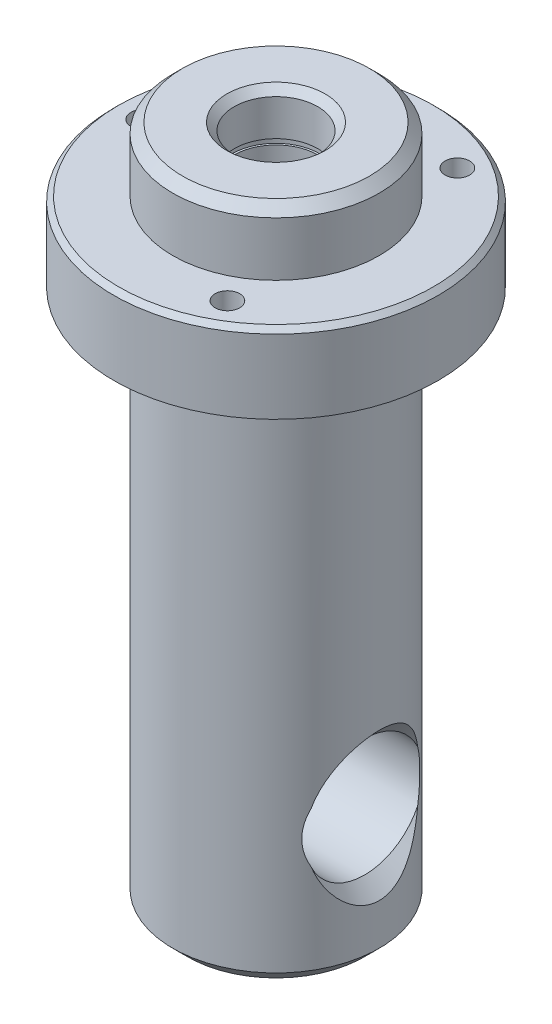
ISO-10303-21;
HEADER;
FILE_DESCRIPTION(('STEP AP214'),'2;1');
FILE_NAME('part.step','',(''),(''),'','','');
FILE_SCHEMA(('AUTOMOTIVE_DESIGN { 1 0 10303 214 1 1 1 1 }'));
ENDSEC;
DATA;
#1=APPLICATION_CONTEXT('core data for automotive mechanical design processes');
#2=APPLICATION_PROTOCOL_DEFINITION('international standard','automotive_design',2000,#1);
#3=PRODUCT_CONTEXT('',#1,'mechanical');
#4=PRODUCT('Part','Part','',(#3));
#5=PRODUCT_RELATED_PRODUCT_CATEGORY('part','',(#4));
#6=PRODUCT_DEFINITION_FORMATION('','',#4);
#7=PRODUCT_DEFINITION_CONTEXT('part definition',#1,'design');
#8=PRODUCT_DEFINITION('design','',#6,#7);
#9=PRODUCT_DEFINITION_SHAPE('','',#8);
#10=(LENGTH_UNIT() NAMED_UNIT(*) SI_UNIT(.MILLI.,.METRE.));
#11=(NAMED_UNIT(*) PLANE_ANGLE_UNIT() SI_UNIT($,.RADIAN.));
#12=(NAMED_UNIT(*) SI_UNIT($,.STERADIAN.) SOLID_ANGLE_UNIT());
#13=UNCERTAINTY_MEASURE_WITH_UNIT(LENGTH_MEASURE(1.E-05),#10,'distance_accuracy_value','');
#14=(GEOMETRIC_REPRESENTATION_CONTEXT(3) GLOBAL_UNCERTAINTY_ASSIGNED_CONTEXT((#13)) GLOBAL_UNIT_ASSIGNED_CONTEXT((#10,
#11,#12)) REPRESENTATION_CONTEXT('',''));
#15=CARTESIAN_POINT('',(0.,0.,0.));
#16=DIRECTION('',(0.,0.,1.));
#17=DIRECTION('',(1.,0.,0.));
#18=AXIS2_PLACEMENT_3D('',#15,#16,#17);
#19=CARTESIAN_POINT('',(0.,0.,0.));
#20=DIRECTION('',(0.,1.,0.));
#21=DIRECTION('',(-1.,0.,0.));
#22=AXIS2_PLACEMENT_3D('',#19,#20,#21);
#23=PLANE('',#22);
#24=CARTESIAN_POINT('',(9.5062846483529E-13,0.,0.));
#25=DIRECTION('',(0.,1.,0.));
#26=DIRECTION('',(-1.,0.,0.));
#27=AXIS2_PLACEMENT_3D('',#24,#25,#26);
#28=CIRCLE('',#27,9.99999999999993);
#29=CARTESIAN_POINT('',(-9.99999999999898,0.,0.));
#30=VERTEX_POINT('',#29);
#31=EDGE_CURVE('E100',#30,#30,#28,.F.);
#32=ORIENTED_EDGE('',*,*,#31,.T.);
#33=EDGE_LOOP('',(#32));
#34=FACE_BOUND('',#33,.T.);
#35=CARTESIAN_POINT('',(9.51052093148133E-13,0.,0.));
#36=DIRECTION('',(0.,1.,0.));
#37=DIRECTION('',(-1.,0.,0.));
#38=AXIS2_PLACEMENT_3D('',#35,#36,#37);
#39=CIRCLE('',#38,19.0000000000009);
#40=CARTESIAN_POINT('',(-18.9999999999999,0.,0.));
#41=VERTEX_POINT('',#40);
#42=EDGE_CURVE('E178',#41,#41,#39,.T.);
#43=ORIENTED_EDGE('',*,*,#42,.T.);
#44=EDGE_LOOP('',(#43));
#45=FACE_BOUND('',#44,.T.);
#46=ADVANCED_FACE('F31',(#34,#45),#23,.T.);
#47=CARTESIAN_POINT('',(0.,-138.,0.));
#48=DIRECTION('',(0.,1.,0.));
#49=DIRECTION('',(-1.,0.,0.));
#50=AXIS2_PLACEMENT_3D('',#47,#48,#49);
#51=CYLINDRICAL_SURFACE('',#50,21.0000000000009);
#52=CARTESIAN_POINT('',(9.37291801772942E-13,-2.00000000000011,0.));
#53=DIRECTION('',(0.,1.,0.));
#54=DIRECTION('',(-1.,0.,0.));
#55=AXIS2_PLACEMENT_3D('',#52,#53,#54);
#56=CIRCLE('',#55,21.0000000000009);
#57=CARTESIAN_POINT('',(-21.,-1.99999999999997,0.));
#58=VERTEX_POINT('',#57);
#59=EDGE_CURVE('E175',#58,#58,#56,.F.);
#60=ORIENTED_EDGE('',*,*,#59,.T.);
#61=EDGE_LOOP('',(#60));
#62=FACE_BOUND('',#61,.T.);
#63=CARTESIAN_POINT('',(8.61610199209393E-13,-13.0000000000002,0.));
#64=DIRECTION('',(0.,1.,0.));
#65=DIRECTION('',(-1.,0.,0.));
#66=AXIS2_PLACEMENT_3D('',#63,#64,#65);
#67=CIRCLE('',#66,21.0000000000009);
#68=CARTESIAN_POINT('',(-21.,-13.,0.));
#69=VERTEX_POINT('',#68);
#70=EDGE_CURVE('E181',#69,#69,#67,.T.);
#71=ORIENTED_EDGE('',*,*,#70,.T.);
#72=EDGE_LOOP('',(#71));
#73=FACE_BOUND('',#72,.T.);
#74=ADVANCED_FACE('F317',(#62,#73),#51,.T.);
#75=CARTESIAN_POINT('',(-21.,-13.,0.));
#76=DIRECTION('',(0.,1.,0.));
#77=DIRECTION('',(-1.,0.,0.));
#78=AXIS2_PLACEMENT_3D('',#75,#76,#77);
#79=PLANE('',#78);
#80=CARTESIAN_POINT('',(13.4999999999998,-13.,-23.38268590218));
#81=DIRECTION('',(0.,1.,0.));
#82=DIRECTION('',(0.,0.,1.));
#83=AXIS2_PLACEMENT_3D('',#80,#81,#82);
#84=CIRCLE('',#83,2.5);
#85=CARTESIAN_POINT('',(13.4999999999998,-13.,-20.88268590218));
#86=VERTEX_POINT('',#85);
#87=EDGE_CURVE('E245',#86,#86,#84,.T.);
#88=ORIENTED_EDGE('',*,*,#87,.F.);
#89=EDGE_LOOP('',(#88));
#90=FACE_BOUND('',#89,.T.);
#91=CARTESIAN_POINT('',(13.5000000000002,-13.,23.3826859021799));
#92=DIRECTION('',(0.,1.,0.));
#93=DIRECTION('',(0.,0.,1.));
#94=AXIS2_PLACEMENT_3D('',#91,#92,#93);
#95=CIRCLE('',#94,2.5);
#96=CARTESIAN_POINT('',(13.5000000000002,-13.,25.8826859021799));
#97=VERTEX_POINT('',#96);
#98=EDGE_CURVE('E239',#97,#97,#95,.T.);
#99=ORIENTED_EDGE('',*,*,#98,.F.);
#100=EDGE_LOOP('',(#99));
#101=FACE_BOUND('',#100,.T.);
#102=CARTESIAN_POINT('',(-27.0000000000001,-13.,0.));
#103=DIRECTION('',(0.,1.,0.));
#104=DIRECTION('',(0.,0.,1.));
#105=AXIS2_PLACEMENT_3D('',#102,#103,#104);
#106=CIRCLE('',#105,2.5);
#107=CARTESIAN_POINT('',(-27.0000000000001,-13.,2.5));
#108=VERTEX_POINT('',#107);
#109=EDGE_CURVE('E233',#108,#108,#106,.T.);
#110=ORIENTED_EDGE('',*,*,#109,.F.);
#111=EDGE_LOOP('',(#110));
#112=FACE_BOUND('',#111,.T.);
#113=CARTESIAN_POINT('',(8.61610199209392E-13,-13.0000000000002,0.));
#114=DIRECTION('',(0.,1.,0.));
#115=DIRECTION('',(-1.,0.,0.));
#116=AXIS2_PLACEMENT_3D('',#113,#114,#115);
#117=CIRCLE('',#116,32.0000000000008);
#118=CARTESIAN_POINT('',(-32.,-13.,0.));
#119=VERTEX_POINT('',#118);
#120=EDGE_CURVE('E172',#119,#119,#117,.T.);
#121=ORIENTED_EDGE('',*,*,#120,.T.);
#122=EDGE_LOOP('',(#121));
#123=FACE_BOUND('',#122,.T.);
#124=ORIENTED_EDGE('',*,*,#70,.F.);
#125=EDGE_LOOP('',(#124));
#126=FACE_BOUND('',#125,.T.);
#127=ADVANCED_FACE('F322',(#90,#101,#112,#123,#126),#79,.T.);
#128=CARTESIAN_POINT('',(0.,-138.,0.));
#129=DIRECTION('',(0.,1.,0.));
#130=DIRECTION('',(-1.,0.,0.));
#131=AXIS2_PLACEMENT_3D('',#128,#129,#130);
#132=CYLINDRICAL_SURFACE('',#131,33.0000000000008);
#133=CARTESIAN_POINT('',(8.54730053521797E-13,-14.0000000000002,0.));
#134=DIRECTION('',(0.,1.,0.));
#135=DIRECTION('',(-1.,0.,0.));
#136=AXIS2_PLACEMENT_3D('',#133,#134,#135);
#137=CIRCLE('',#136,33.0000000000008);
#138=CARTESIAN_POINT('',(-33.,-14.,0.));
#139=VERTEX_POINT('',#138);
#140=EDGE_CURVE('E169',#139,#139,#137,.F.);
#141=ORIENTED_EDGE('',*,*,#140,.T.);
#142=EDGE_LOOP('',(#141));
#143=FACE_BOUND('',#142,.T.);
#144=CARTESIAN_POINT('',(7.51527868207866E-13,-29.0000000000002,0.));
#145=DIRECTION('',(0.,1.,0.));
#146=DIRECTION('',(-1.,0.,0.));
#147=AXIS2_PLACEMENT_3D('',#144,#145,#146);
#148=CIRCLE('',#147,33.0000000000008);
#149=CARTESIAN_POINT('',(-33.,-29.,0.));
#150=VERTEX_POINT('',#149);
#151=EDGE_CURVE('E184',#150,#150,#148,.T.);
#152=ORIENTED_EDGE('',*,*,#151,.T.);
#153=EDGE_LOOP('',(#152));
#154=FACE_BOUND('',#153,.T.);
#155=ADVANCED_FACE('F347',(#143,#154),#132,.T.);
#156=CARTESIAN_POINT('',(-33.,-29.,0.));
#157=DIRECTION('',(0.,-1.,0.));
#158=DIRECTION('',(1.,0.,0.));
#159=AXIS2_PLACEMENT_3D('',#156,#157,#158);
#160=PLANE('',#159);
#161=CARTESIAN_POINT('',(7.51527868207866E-13,-29.0000000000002,0.));
#162=DIRECTION('',(0.,1.,0.));
#163=DIRECTION('',(-1.,0.,0.));
#164=AXIS2_PLACEMENT_3D('',#161,#162,#163);
#165=CIRCLE('',#164,26.0000000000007);
#166=CARTESIAN_POINT('',(-25.9999999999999,-29.,0.));
#167=VERTEX_POINT('',#166);
#168=EDGE_CURVE('E187',#167,#167,#165,.T.);
#169=ORIENTED_EDGE('',*,*,#168,.T.);
#170=EDGE_LOOP('',(#169));
#171=FACE_BOUND('',#170,.T.);
#172=ORIENTED_EDGE('',*,*,#151,.F.);
#173=EDGE_LOOP('',(#172));
#174=FACE_BOUND('',#173,.T.);
#175=ADVANCED_FACE('F352',(#171,#174),#160,.T.);
#176=CARTESIAN_POINT('',(7.51527868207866E-13,-29.0000000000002,0.));
#177=DIRECTION('',(0.,1.,0.));
#178=DIRECTION('',(-1.,0.,0.));
#179=AXIS2_PLACEMENT_3D('',#176,#177,#178);
#180=CONICAL_SURFACE('',#179,26.0000000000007,0.78539816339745);
#181=CARTESIAN_POINT('',(7.17127139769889E-13,-34.0000000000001,0.));
#182=DIRECTION('',(0.,1.,0.));
#183=DIRECTION('',(-1.,0.,0.));
#184=AXIS2_PLACEMENT_3D('',#181,#182,#183);
#185=CIRCLE('',#184,21.0000000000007);
#186=CARTESIAN_POINT('',(-21.,-34.,0.));
#187=VERTEX_POINT('',#186);
#188=EDGE_CURVE('E190',#187,#187,#185,.T.);
#189=ORIENTED_EDGE('',*,*,#188,.T.);
#190=EDGE_LOOP('',(#189));
#191=FACE_BOUND('',#190,.T.);
#192=ORIENTED_EDGE('',*,*,#168,.F.);
#193=EDGE_LOOP('',(#192));
#194=FACE_BOUND('',#193,.T.);
#195=ADVANCED_FACE('F359',(#191,#194),#180,.T.);
#196=CARTESIAN_POINT('',(0.,-138.,0.));
#197=DIRECTION('',(0.,1.,0.));
#198=DIRECTION('',(-1.,0.,0.));
#199=AXIS2_PLACEMENT_3D('',#196,#197,#198);
#200=CYLINDRICAL_SURFACE('',#199,21.0000000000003);
#201=CARTESIAN_POINT('',(17.6998000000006,-114.627910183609,11.3011981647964));
#202=CARTESIAN_POINT('',(17.7233754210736,-114.856862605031,11.2642655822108));
#203=CARTESIAN_POINT('',(17.7494790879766,-115.084846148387,11.2231374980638));
#204=CARTESIAN_POINT('',(17.8064558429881,-115.538534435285,11.1325215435));
#205=CARTESIAN_POINT('',(17.8373287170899,-115.764239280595,11.0830340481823));
#206=CARTESIAN_POINT('',(17.9366543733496,-116.437321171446,10.9221057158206));
#207=CARTESIAN_POINT('',(18.0118285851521,-116.880802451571,10.7981769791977));
#208=CARTESIAN_POINT('',(18.1780748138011,-117.758627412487,10.5159238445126));
#209=CARTESIAN_POINT('',(18.2692991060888,-118.192834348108,10.3572660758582));
#210=CARTESIAN_POINT('',(18.4638395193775,-119.044673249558,10.0063418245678));
#211=CARTESIAN_POINT('',(18.5671558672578,-119.462304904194,9.81407471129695));
#212=CARTESIAN_POINT('',(18.7829838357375,-120.280443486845,9.39444074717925));
#213=CARTESIAN_POINT('',(18.8955470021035,-120.680832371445,9.16686983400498));
#214=CARTESIAN_POINT('',(19.1255030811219,-121.458420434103,8.67688959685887));
#215=CARTESIAN_POINT('',(19.2428970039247,-121.835614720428,8.41447296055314));
#216=CARTESIAN_POINT('',(19.4778580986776,-122.560980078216,7.85522668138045));
#217=CARTESIAN_POINT('',(19.5954224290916,-122.909267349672,7.55854755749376));
#218=CARTESIAN_POINT('',(19.826595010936,-123.572968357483,6.92953515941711));
#219=CARTESIAN_POINT('',(19.94020622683,-123.888407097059,6.5972293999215));
#220=CARTESIAN_POINT('',(20.1796979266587,-124.537335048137,5.82847537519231));
#221=CARTESIAN_POINT('',(20.3037250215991,-124.862592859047,5.38429763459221));
#222=CARTESIAN_POINT('',(20.4728930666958,-125.297395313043,4.68174742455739));
#223=CARTESIAN_POINT('',(20.5264651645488,-125.433469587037,4.44154623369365));
#224=CARTESIAN_POINT('',(20.626743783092,-125.685989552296,3.94972264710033));
#225=CARTESIAN_POINT('',(20.6734542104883,-125.802446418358,3.69810685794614));
#226=CARTESIAN_POINT('',(20.7524660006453,-125.998109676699,3.22248547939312));
#227=CARTESIAN_POINT('',(20.7858764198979,-126.080276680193,2.99987888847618));
#228=CARTESIAN_POINT('',(20.8460529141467,-126.227605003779,2.54831540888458));
#229=CARTESIAN_POINT('',(20.8728221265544,-126.292774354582,2.31936157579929));
#230=CARTESIAN_POINT('',(20.9190811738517,-126.405033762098,1.85638010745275));
#231=CARTESIAN_POINT('',(20.9385726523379,-126.452127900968,1.62235363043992));
#232=CARTESIAN_POINT('',(20.9697787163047,-126.527385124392,1.15074672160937));
#233=CARTESIAN_POINT('',(20.9814932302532,-126.555548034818,0.913166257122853));
#234=CARTESIAN_POINT('',(20.9968472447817,-126.592439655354,0.435511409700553));
#235=CARTESIAN_POINT('',(21.0004622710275,-126.601109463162,0.195431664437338));
#236=CARTESIAN_POINT('',(20.9994430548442,-126.598663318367,-0.28460911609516));
#237=CARTESIAN_POINT('',(20.9948087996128,-126.587547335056,-0.524570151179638));
#238=CARTESIAN_POINT('',(20.9774202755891,-126.545754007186,-1.00251416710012));
#239=CARTESIAN_POINT('',(20.9646647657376,-126.515073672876,-1.24049683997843));
#240=CARTESIAN_POINT('',(20.9313826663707,-126.434757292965,-1.71267257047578));
#241=CARTESIAN_POINT('',(20.9108560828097,-126.385121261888,-1.94686563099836));
#242=CARTESIAN_POINT('',(20.8635973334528,-126.270320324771,-2.39998857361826));
#243=CARTESIAN_POINT('',(20.8371686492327,-126.205911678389,-2.6191425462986));
#244=CARTESIAN_POINT('',(20.7782653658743,-126.061566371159,-3.05145281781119));
#245=CARTESIAN_POINT('',(20.7457889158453,-125.981624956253,-3.26460725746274));
#246=CARTESIAN_POINT('',(20.6402464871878,-125.720097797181,-3.893664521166));
#247=CARTESIAN_POINT('',(20.5590430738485,-125.516750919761,-4.29938486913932));
#248=CARTESIAN_POINT('',(20.4051188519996,-125.123875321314,-4.97148770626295));
#249=CARTESIAN_POINT('',(20.3361498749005,-124.945771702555,-5.24563576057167));
#250=CARTESIAN_POINT('',(20.1918508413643,-124.567070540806,-5.77621335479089));
#251=CARTESIAN_POINT('',(20.1165201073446,-124.366470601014,-6.03264100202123));
#252=CARTESIAN_POINT('',(19.9613088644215,-123.945217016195,-6.52791732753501));
#253=CARTESIAN_POINT('',(19.8814185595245,-123.724519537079,-6.76672542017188));
#254=CARTESIAN_POINT('',(19.7190667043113,-123.265924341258,-7.22618588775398));
#255=CARTESIAN_POINT('',(19.6366051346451,-123.028026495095,-7.44683812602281));
#256=CARTESIAN_POINT('',(19.4441005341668,-122.458089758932,-7.93834355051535));
#257=CARTESIAN_POINT('',(19.3337185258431,-122.1203858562,-8.20251103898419));
#258=CARTESIAN_POINT('',(19.1149351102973,-121.422432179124,-8.70018204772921));
#259=CARTESIAN_POINT('',(19.006534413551,-121.062174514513,-8.9336747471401));
#260=CARTESIAN_POINT('',(18.7950073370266,-120.322327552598,-9.37051715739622));
#261=CARTESIAN_POINT('',(18.6918816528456,-119.942735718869,-9.57386289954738));
#262=CARTESIAN_POINT('',(18.4940184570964,-119.167032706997,-9.95070708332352));
#263=CARTESIAN_POINT('',(18.3992788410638,-118.770925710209,-10.1242130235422));
#264=CARTESIAN_POINT('',(18.2440395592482,-118.068562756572,-10.4006362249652));
#265=CARTESIAN_POINT('',(18.1810087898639,-117.765464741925,-10.5102205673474));
#266=CARTESIAN_POINT('',(18.0622565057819,-117.152478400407,-10.7130148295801));
#267=CARTESIAN_POINT('',(18.0065337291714,-116.842591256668,-10.8062275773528));
#268=CARTESIAN_POINT('',(17.9035856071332,-116.217960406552,-10.975951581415));
#269=CARTESIAN_POINT('',(17.8563340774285,-115.903235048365,-11.0525144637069));
#270=CARTESIAN_POINT('',(17.7709800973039,-115.268934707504,-11.1892139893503));
#271=CARTESIAN_POINT('',(17.7328798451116,-114.949358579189,-11.2493466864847));
#272=CARTESIAN_POINT('',(17.6998000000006,-114.627910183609,-11.3011981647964));
#273=B_SPLINE_CURVE_WITH_KNOTS('',3,(#201,#202,#203,#204,#205,#206,#207,#208,#209,#210,#211,
#212,#213,#214,#215,#216,#217,#218,#219,#220,#221,#222,#223,#224,#225,#226,#227,#228,#229,#230,
#231,#232,#233,#234,#235,#236,#237,#238,#239,#240,#241,#242,#243,#244,#245,#246,#247,#248,#249,
#250,#251,#252,#253,#254,#255,#256,#257,#258,#259,#260,#261,#262,#263,#264,#265,#266,#267,#268,
#269,#270,#271,#272),.UNSPECIFIED.,.F.,.F.,(4,2,2,2,2,2,2,2,2,2,2,2,2,2,2,2,2,2,2,2,2,2,2,2,2,2,
2,2,2,2,2,2,2,2,2,4),(0.,0.699208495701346,1.39838562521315,2.796323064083,4.20831903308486,
5.62034149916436,7.04085270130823,8.46166246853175,9.8764522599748,11.290157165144,
12.9762344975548,13.8190808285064,14.6614454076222,15.3796102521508,16.0974351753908,
16.8150978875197,17.5327672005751,18.2526021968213,18.972438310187,19.6923844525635,
20.4123300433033,21.1014365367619,21.7907542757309,23.1686997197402,24.1698681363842,
25.1711433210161,26.1746571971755,27.1781786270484,28.5045312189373,29.8313504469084,
31.158344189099,32.4850039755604,33.4696980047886,34.4542217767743,35.4356478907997,
36.4173095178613),.UNSPECIFIED.);
#274=CARTESIAN_POINT('',(18.0000000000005,-116.796152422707,10.816653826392));
#275=VERTEX_POINT('',#274);
#276=CARTESIAN_POINT('',(18.0000000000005,-116.796152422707,-10.816653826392));
#277=VERTEX_POINT('',#276);
#278=EDGE_CURVE('E44',#275,#277,#273,.T.);
#279=ORIENTED_EDGE('',*,*,#278,.F.);
#280=CARTESIAN_POINT('',(21.0000000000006,-99.6000000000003,0.));
#281=CARTESIAN_POINT('',(20.9999975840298,-99.6000026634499,0.309522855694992));
#282=CARTESIAN_POINT('',(20.9931388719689,-99.6119944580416,0.619141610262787));
#283=CARTESIAN_POINT('',(20.9658672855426,-99.6598171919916,1.23606791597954));
#284=CARTESIAN_POINT('',(20.9454459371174,-99.6956630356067,1.54337390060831));
#285=CARTESIAN_POINT('',(20.8915025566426,-99.790833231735,2.15388740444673));
#286=CARTESIAN_POINT('',(20.8579507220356,-99.8502109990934,2.45708396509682));
#287=CARTESIAN_POINT('',(20.7785867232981,-99.9916801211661,3.0564221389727));
#288=CARTESIAN_POINT('',(20.7327763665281,-100.07376812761,3.3525647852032));
#289=CARTESIAN_POINT('',(20.6302293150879,-100.259263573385,3.93453085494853));
#290=CARTESIAN_POINT('',(20.573545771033,-100.362567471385,4.22039675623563));
#291=CARTESIAN_POINT('',(20.4503833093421,-100.589674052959,4.78167205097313));
#292=CARTESIAN_POINT('',(20.3839040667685,-100.713477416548,5.05708109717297));
#293=CARTESIAN_POINT('',(20.2426090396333,-100.980393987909,5.5959200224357));
#294=CARTESIAN_POINT('',(20.1677981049,-101.123495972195,5.85935674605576));
#295=CARTESIAN_POINT('',(20.0112990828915,-101.428021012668,6.37339229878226));
#296=CARTESIAN_POINT('',(19.9296084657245,-101.589450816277,6.62398635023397));
#297=CARTESIAN_POINT('',(19.7548873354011,-101.941809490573,7.12887289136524));
#298=CARTESIAN_POINT('',(19.6614638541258,-102.134025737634,7.38213105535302));
#299=CARTESIAN_POINT('',(19.4706137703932,-102.537091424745,7.87173733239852));
#300=CARTESIAN_POINT('',(19.3731870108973,-102.747941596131,8.10808478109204));
#301=CARTESIAN_POINT('',(19.1763459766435,-103.187456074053,8.56325309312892));
#302=CARTESIAN_POINT('',(19.0769296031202,-103.41614001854,8.78205408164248));
#303=CARTESIAN_POINT('',(18.878439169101,-103.890149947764,9.20099297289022));
#304=CARTESIAN_POINT('',(18.779365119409,-104.135476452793,9.4011302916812));
#305=CARTESIAN_POINT('',(18.5732442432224,-104.669452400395,9.80259627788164));
#306=CARTESIAN_POINT('',(18.4665032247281,-104.959910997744,10.0016840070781));
#307=CARTESIAN_POINT('',(18.259651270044,-105.558984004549,10.3745172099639));
#308=CARTESIAN_POINT('',(18.1595412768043,-105.867600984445,10.5482590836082));
#309=CARTESIAN_POINT('',(17.9696169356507,-106.501144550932,10.8686484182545));
#310=CARTESIAN_POINT('',(17.8797900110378,-106.826050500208,11.0153291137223));
#311=CARTESIAN_POINT('',(17.7139289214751,-107.490660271,11.2801227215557));
#312=CARTESIAN_POINT('',(17.6378902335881,-107.830359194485,11.3982450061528));
#313=CARTESIAN_POINT('',(17.5180108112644,-108.445553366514,11.5813844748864));
#314=CARTESIAN_POINT('',(17.4707685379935,-108.718622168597,11.6523689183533));
#315=CARTESIAN_POINT('',(17.3882361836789,-109.270791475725,11.7751744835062));
#316=CARTESIAN_POINT('',(17.3529437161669,-109.549890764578,11.8269994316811));
#317=CARTESIAN_POINT('',(17.2955360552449,-110.112150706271,11.9107942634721));
#318=CARTESIAN_POINT('',(17.2734091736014,-110.395307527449,11.9427817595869));
#319=CARTESIAN_POINT('',(17.2430850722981,-110.963938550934,11.9865229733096));
#320=CARTESIAN_POINT('',(17.2348881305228,-111.249412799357,11.9982762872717));
#321=CARTESIAN_POINT('',(17.2327316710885,-111.820914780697,12.0013734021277));
#322=CARTESIAN_POINT('',(17.2387915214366,-112.106942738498,11.9926894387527));
#323=CARTESIAN_POINT('',(17.2649600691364,-112.676999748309,11.9549853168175));
#324=CARTESIAN_POINT('',(17.2850688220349,-112.961028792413,11.9259650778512));
#325=CARTESIAN_POINT('',(17.3386139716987,-113.525216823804,11.8479826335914));
#326=CARTESIAN_POINT('',(17.3720581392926,-113.805373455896,11.7990088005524));
#327=CARTESIAN_POINT('',(17.4511158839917,-114.359850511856,11.6817610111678));
#328=CARTESIAN_POINT('',(17.4967297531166,-114.634170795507,11.6134865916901));
#329=CARTESIAN_POINT('',(17.5984602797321,-115.174336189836,11.4587399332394));
#330=CARTESIAN_POINT('',(17.6545321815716,-115.440211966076,11.3723450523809));
#331=CARTESIAN_POINT('',(17.7757011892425,-115.963533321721,11.1820018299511));
#332=CARTESIAN_POINT('',(17.8408014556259,-116.220975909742,11.0780473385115));
#333=CARTESIAN_POINT('',(18.047099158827,-116.979040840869,10.7411175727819));
#334=CARTESIAN_POINT('',(18.1993477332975,-117.465672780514,10.4829969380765));
#335=CARTESIAN_POINT('',(18.5456054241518,-118.469972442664,9.85934987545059));
#336=CARTESIAN_POINT('',(18.7423969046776,-118.980116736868,9.4832401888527));
#337=CARTESIAN_POINT('',(19.0393169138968,-119.695839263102,8.86325467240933));
#338=CARTESIAN_POINT('',(19.138665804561,-119.926342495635,8.6470779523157));
#339=CARTESIAN_POINT('',(19.3357581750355,-120.369893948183,8.19687346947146));
#340=CARTESIAN_POINT('',(19.4335021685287,-120.58294784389,7.96285155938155));
#341=CARTESIAN_POINT('',(19.6362195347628,-121.013888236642,7.45005653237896));
#342=CARTESIAN_POINT('',(19.7407422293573,-121.229543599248,7.16922574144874));
#343=CARTESIAN_POINT('',(19.9423276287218,-121.636315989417,6.58773491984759));
#344=CARTESIAN_POINT('',(20.0393896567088,-121.827430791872,6.2870730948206));
#345=CARTESIAN_POINT('',(20.2232929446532,-122.183230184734,5.66769121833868));
#346=CARTESIAN_POINT('',(20.3101389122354,-122.347926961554,5.34897958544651));
#347=CARTESIAN_POINT('',(20.4711099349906,-122.649097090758,4.6954090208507));
#348=CARTESIAN_POINT('',(20.5452365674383,-122.785573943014,4.36055209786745));
#349=CARTESIAN_POINT('',(20.6738737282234,-123.020069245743,3.70080771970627));
#350=CARTESIAN_POINT('',(20.7293853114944,-123.120092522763,3.37682840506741));
#351=CARTESIAN_POINT('',(20.8258159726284,-123.292721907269,2.71950215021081));
#352=CARTESIAN_POINT('',(20.866735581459,-123.36532901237,2.3861555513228));
#353=CARTESIAN_POINT('',(20.9327267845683,-123.481976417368,1.713228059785));
#354=CARTESIAN_POINT('',(20.9578113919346,-123.526040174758,1.37365252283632));
#355=CARTESIAN_POINT('',(20.9914017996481,-123.584971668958,0.691174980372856));
#356=CARTESIAN_POINT('',(20.9999094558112,-123.599842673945,0.348273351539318));
#357=CARTESIAN_POINT('',(21.000078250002,-123.600135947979,-0.295857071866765));
#358=CARTESIAN_POINT('',(20.9936594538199,-123.588914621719,-0.597090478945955));
#359=CARTESIAN_POINT('',(20.9679919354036,-123.543911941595,-1.19729317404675));
#360=CARTESIAN_POINT('',(20.9487444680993,-123.510132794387,-1.49626268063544));
#361=CARTESIAN_POINT('',(20.8978837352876,-123.420444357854,-2.08978082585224));
#362=CARTESIAN_POINT('',(20.8662705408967,-123.364535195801,-2.384329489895));
#363=CARTESIAN_POINT('',(20.791418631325,-123.231256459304,-2.96701920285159));
#364=CARTESIAN_POINT('',(20.748179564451,-123.153886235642,-3.2551600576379));
#365=CARTESIAN_POINT('',(20.6515541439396,-122.979450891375,-3.82029452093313));
#366=CARTESIAN_POINT('',(20.5982776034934,-122.882598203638,-4.09737271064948));
#367=CARTESIAN_POINT('',(20.4824154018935,-122.669657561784,-4.64200153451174));
#368=CARTESIAN_POINT('',(20.4198299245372,-122.553569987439,-4.90955235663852));
#369=CARTESIAN_POINT('',(20.2866026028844,-122.30315296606,-5.43386830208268));
#370=CARTESIAN_POINT('',(20.215960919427,-122.1688238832,-5.69063364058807));
#371=CARTESIAN_POINT('',(20.0679440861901,-121.882866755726,-6.19242141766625));
#372=CARTESIAN_POINT('',(19.9905665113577,-121.73123247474,-6.43743957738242));
#373=CARTESIAN_POINT('',(19.8221944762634,-121.395035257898,-6.93958344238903));
#374=CARTESIAN_POINT('',(19.7306205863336,-121.20868792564,-7.19532119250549));
#375=CARTESIAN_POINT('',(19.5430063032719,-120.817298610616,-7.69031721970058));
#376=CARTESIAN_POINT('',(19.4469656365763,-120.612255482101,-7.92957448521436));
#377=CARTESIAN_POINT('',(19.2523830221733,-120.184323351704,-8.3909773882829));
#378=CARTESIAN_POINT('',(19.1538385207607,-119.961415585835,-8.6131045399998));
#379=CARTESIAN_POINT('',(18.956505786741,-119.498914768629,-9.03913771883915));
#380=CARTESIAN_POINT('',(18.8577175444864,-119.259321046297,-9.2430430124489));
#381=CARTESIAN_POINT('',(18.6512297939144,-118.73668437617,-9.65350316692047));
#382=CARTESIAN_POINT('',(18.5437670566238,-118.451777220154,-9.85781121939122));
#383=CARTESIAN_POINT('',(18.3345970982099,-117.863623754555,-10.2415981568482));
#384=CARTESIAN_POINT('',(18.232890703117,-117.560374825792,-10.4210734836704));
#385=CARTESIAN_POINT('',(18.0388112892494,-116.937251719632,-10.7535253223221));
#386=CARTESIAN_POINT('',(17.9464283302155,-116.6173958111,-10.9065301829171));
#387=CARTESIAN_POINT('',(17.774463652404,-115.962482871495,-11.1845964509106));
#388=CARTESIAN_POINT('',(17.6948780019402,-115.627430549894,-11.3096664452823));
#389=CARTESIAN_POINT('',(17.5672561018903,-115.017242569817,-11.506614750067));
#390=CARTESIAN_POINT('',(17.5161112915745,-114.74457145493,-11.5841485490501));
#391=CARTESIAN_POINT('',(17.4254860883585,-114.192607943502,-11.7200307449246));
#392=CARTESIAN_POINT('',(17.3860033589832,-113.913316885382,-11.7783829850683));
#393=CARTESIAN_POINT('',(17.3200607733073,-113.350042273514,-11.8751392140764));
#394=CARTESIAN_POINT('',(17.2935886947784,-113.066063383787,-11.9135619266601));
#395=CARTESIAN_POINT('',(17.2545686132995,-112.495117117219,-11.9700062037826));
#396=CARTESIAN_POINT('',(17.2420208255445,-112.208149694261,-11.9880274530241));
#397=CARTESIAN_POINT('',(17.2313141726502,-111.632807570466,-12.0034121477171));
#398=CARTESIAN_POINT('',(17.2331844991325,-111.344431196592,-12.0007336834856));
#399=CARTESIAN_POINT('',(17.2513115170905,-110.769076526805,-11.9746606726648));
#400=CARTESIAN_POINT('',(17.2675682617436,-110.482098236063,-11.9512660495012));
#401=CARTESIAN_POINT('',(17.3138686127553,-109.911520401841,-11.8840905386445));
#402=CARTESIAN_POINT('',(17.343919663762,-109.627922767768,-11.840298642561));
#403=CARTESIAN_POINT('',(17.4167354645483,-109.066176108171,-11.732924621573));
#404=CARTESIAN_POINT('',(17.4595004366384,-108.788027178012,-11.6693421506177));
#405=CARTESIAN_POINT('',(17.5554693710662,-108.243656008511,-11.5244478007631));
#406=CARTESIAN_POINT('',(17.6084759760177,-107.977309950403,-11.4434682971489));
#407=CARTESIAN_POINT('',(17.7238615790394,-107.452614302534,-11.2639296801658));
#408=CARTESIAN_POINT('',(17.7862437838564,-107.194267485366,-11.1653645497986));
#409=CARTESIAN_POINT('',(17.9187335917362,-106.686644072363,-10.9514749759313));
#410=CARTESIAN_POINT('',(17.9888419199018,-106.437368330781,-10.8361489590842));
#411=CARTESIAN_POINT('',(18.1351192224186,-105.948725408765,-10.5895232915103));
#412=CARTESIAN_POINT('',(18.2112881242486,-105.709358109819,-10.4582238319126));
#413=CARTESIAN_POINT('',(18.3801499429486,-105.205101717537,-10.1589355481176));
#414=CARTESIAN_POINT('',(18.4735807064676,-104.941962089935,-9.98841069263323));
#415=CARTESIAN_POINT('',(18.6639600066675,-104.430640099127,-9.6279872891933));
#416=CARTESIAN_POINT('',(18.7609088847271,-104.182459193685,-9.43808685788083));
#417=CARTESIAN_POINT('',(18.9561081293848,-103.701752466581,-9.0396464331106));
#418=CARTESIAN_POINT('',(19.0543593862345,-103.469238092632,-8.83109306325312));
#419=CARTESIAN_POINT('',(19.2499275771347,-103.020932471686,-8.39625729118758));
#420=CARTESIAN_POINT('',(19.3472443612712,-102.805143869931,-8.16997209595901));
#421=CARTESIAN_POINT('',(19.5508162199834,-102.365445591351,-7.67117303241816));
#422=CARTESIAN_POINT('',(19.6566700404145,-102.143886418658,-7.39641492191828));
#423=CARTESIAN_POINT('',(19.8616466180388,-101.724860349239,-6.82689863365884));
#424=CARTESIAN_POINT('',(19.9607718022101,-101.52738474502,-6.53214774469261));
#425=CARTESIAN_POINT('',(20.1496021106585,-101.158178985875,-5.92409184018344));
#426=CARTESIAN_POINT('',(20.2393081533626,-100.986446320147,-5.61078863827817));
#427=CARTESIAN_POINT('',(20.4067128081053,-100.670596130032,-4.9675373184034));
#428=CARTESIAN_POINT('',(20.4844147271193,-100.526470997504,-4.63759381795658));
#429=CARTESIAN_POINT('',(20.6129238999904,-100.290686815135,-4.02338086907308));
#430=CARTESIAN_POINT('',(20.6660566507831,-100.194255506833,-3.74142065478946));
#431=CARTESIAN_POINT('',(20.7614719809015,-100.022269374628,-3.16943106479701));
#432=CARTESIAN_POINT('',(20.8037564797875,-99.9467108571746,-2.87940312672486));
#433=CARTESIAN_POINT('',(20.8764287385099,-99.8174652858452,-2.29381256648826));
#434=CARTESIAN_POINT('',(20.9068455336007,-99.763724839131,-1.99826532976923));
#435=CARTESIAN_POINT('',(20.9551997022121,-99.6785220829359,-1.40308275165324));
#436=CARTESIAN_POINT('',(20.9731441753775,-99.6470470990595,-1.10344983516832));
#437=CARTESIAN_POINT('',(20.9897566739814,-99.6179331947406,-0.669340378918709));
#438=CARTESIAN_POINT('',(20.9935953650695,-99.6112110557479,-0.535603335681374));
#439=CARTESIAN_POINT('',(20.9987176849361,-99.6022436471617,-0.2679168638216));
#440=CARTESIAN_POINT('',(21.000001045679,-99.5999988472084,-0.133967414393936));
#441=CARTESIAN_POINT('',(21.0000000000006,-99.6000000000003,0.));
#442=B_SPLINE_CURVE_WITH_KNOTS('',3,(#280,#281,#282,#283,#284,#285,#286,#287,#288,#289,#290,
#291,#292,#293,#294,#295,#296,#297,#298,#299,#300,#301,#302,#303,#304,#305,#306,#307,#308,#309,
#310,#311,#312,#313,#314,#315,#316,#317,#318,#319,#320,#321,#322,#323,#324,#325,#326,#327,#328,
#329,#330,#331,#332,#333,#334,#335,#336,#337,#338,#339,#340,#341,#342,#343,#344,#345,#346,#347,
#348,#349,#350,#351,#352,#353,#354,#355,#356,#357,#358,#359,#360,#361,#362,#363,#364,#365,#366,
#367,#368,#369,#370,#371,#372,#373,#374,#375,#376,#377,#378,#379,#380,#381,#382,#383,#384,#385,
#386,#387,#388,#389,#390,#391,#392,#393,#394,#395,#396,#397,#398,#399,#400,#401,#402,#403,#404,
#405,#406,#407,#408,#409,#410,#411,#412,#413,#414,#415,#416,#417,#418,#419,#420,#421,#422,#423,
#424,#425,#426,#427,#428,#429,#430,#431,#432,#433,#434,#435,#436,#437,#438,#439,#440,#441),
.UNSPECIFIED.,.T.,.F.,(4,2,2,2,2,2,2,2,2,2,2,2,2,2,2,2,2,2,2,2,2,2,2,2,2,2,2,2,2,2,2,2,2,2,2,2,
2,2,2,2,2,2,2,2,2,2,2,2,2,2,2,2,2,2,2,2,2,2,2,2,2,2,2,2,2,2,2,2,2,2,2,2,2,2,2,2,2,2,2,2,4),(0.,
0.928428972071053,1.85743858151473,2.78856912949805,3.71956246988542,4.64611581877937,
5.57269990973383,6.49874743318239,7.42513699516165,8.41827045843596,9.41144291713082,
10.4057249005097,11.4000379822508,12.5025662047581,13.6052508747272,14.7065721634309,
15.8075315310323,16.664868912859,17.5220349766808,18.3784389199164,19.2348599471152,
20.0924451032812,20.9500336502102,21.8081226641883,22.6662322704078,23.5207504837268,
24.3755685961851,26.0843469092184,28.0669593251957,29.0599862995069,30.0526889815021,
31.1588589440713,32.2651291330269,33.3708875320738,34.4765087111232,35.5057877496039,
36.5350293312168,37.563423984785,38.5917035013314,39.4951301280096,40.398468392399,
41.3018014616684,42.2051618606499,43.0991596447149,43.9931397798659,44.8871020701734,
45.7813875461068,46.7686101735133,47.7558933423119,48.7442274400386,49.7326013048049,
50.8313456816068,51.9302473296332,53.0279647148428,54.1253442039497,54.9886403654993,
55.8517634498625,56.7140741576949,57.5763981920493,58.440468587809,59.3045421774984,
60.1690826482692,61.0336382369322,61.8829498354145,62.7325525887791,63.5822351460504,
64.4319075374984,65.4124821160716,66.3931521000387,67.3745310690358,68.3560649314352,
69.4601606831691,70.5638560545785,71.6674437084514,72.7707267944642,73.6778518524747,
74.5848162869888,75.4895476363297,76.3937635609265,76.7955632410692,77.1974050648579),.UNSPECIFIED.);
#443=CARTESIAN_POINT('',(18.0000000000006,-106.403847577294,10.816653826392));
#444=VERTEX_POINT('',#443);
#445=EDGE_CURVE('E91',#444,#275,#442,.T.);
#446=ORIENTED_EDGE('',*,*,#445,.F.);
#447=CARTESIAN_POINT('',(17.6998000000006,-108.572089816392,-11.3011981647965));
#448=CARTESIAN_POINT('',(17.7233754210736,-108.34313739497,-11.2642655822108));
#449=CARTESIAN_POINT('',(17.7494790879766,-108.115153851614,-11.2231374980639));
#450=CARTESIAN_POINT('',(17.8064558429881,-107.661465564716,-11.1325215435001));
#451=CARTESIAN_POINT('',(17.8373287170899,-107.435760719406,-11.0830340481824));
#452=CARTESIAN_POINT('',(17.9366543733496,-106.762678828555,-10.9221057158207));
#453=CARTESIAN_POINT('',(18.0118285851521,-106.31919754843,-10.7981769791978));
#454=CARTESIAN_POINT('',(18.1780748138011,-105.441372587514,-10.5159238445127));
#455=CARTESIAN_POINT('',(18.2692991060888,-105.007165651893,-10.3572660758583));
#456=CARTESIAN_POINT('',(18.4638395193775,-104.155326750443,-10.0063418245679));
#457=CARTESIAN_POINT('',(18.5671558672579,-103.737695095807,-9.81407471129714));
#458=CARTESIAN_POINT('',(18.7829838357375,-102.919556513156,-9.39444074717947));
#459=CARTESIAN_POINT('',(18.8955470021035,-102.519167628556,-9.16686983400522));
#460=CARTESIAN_POINT('',(19.125503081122,-101.741579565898,-8.67688959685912));
#461=CARTESIAN_POINT('',(19.2428970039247,-101.364385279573,-8.41447296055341));
#462=CARTESIAN_POINT('',(19.4778580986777,-100.639019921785,-7.85522668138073));
#463=CARTESIAN_POINT('',(19.5954224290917,-100.290732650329,-7.55854755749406));
#464=CARTESIAN_POINT('',(19.8265950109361,-99.6270316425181,-6.92953515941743));
#465=CARTESIAN_POINT('',(19.94020622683,-99.3115929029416,-6.59722939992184));
#466=CARTESIAN_POINT('',(20.1796979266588,-98.6626649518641,-5.82847537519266));
#467=CARTESIAN_POINT('',(20.3037250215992,-98.3374071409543,-5.38429763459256));
#468=CARTESIAN_POINT('',(20.4728930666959,-97.9026046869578,-4.68174742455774));
#469=CARTESIAN_POINT('',(20.5264651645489,-97.7665304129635,-4.441546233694));
#470=CARTESIAN_POINT('',(20.6267437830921,-97.5140104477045,-3.94972264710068));
#471=CARTESIAN_POINT('',(20.6734542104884,-97.397553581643,-3.6981068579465));
#472=CARTESIAN_POINT('',(20.7524660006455,-97.2018903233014,-3.22248547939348));
#473=CARTESIAN_POINT('',(20.785876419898,-97.1197233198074,-2.99987888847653));
#474=CARTESIAN_POINT('',(20.8460529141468,-96.9723949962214,-2.54831540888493));
#475=CARTESIAN_POINT('',(20.8728221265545,-96.907225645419,-2.31936157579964));
#476=CARTESIAN_POINT('',(20.9190811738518,-96.7949662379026,-1.85638010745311));
#477=CARTESIAN_POINT('',(20.9385726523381,-96.7478720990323,-1.62235363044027));
#478=CARTESIAN_POINT('',(20.9697787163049,-96.6726148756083,-1.15074672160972));
#479=CARTESIAN_POINT('',(20.9814932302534,-96.6444519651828,-0.913166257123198));
#480=CARTESIAN_POINT('',(20.9968472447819,-96.6075603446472,-0.435511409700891));
#481=CARTESIAN_POINT('',(21.0004622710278,-96.5988905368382,-0.195431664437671));
#482=CARTESIAN_POINT('',(20.9994430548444,-96.601336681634,0.284609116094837));
#483=CARTESIAN_POINT('',(20.9948087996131,-96.6124526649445,0.524570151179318));
#484=CARTESIAN_POINT('',(20.9774202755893,-96.6542459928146,1.00251416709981));
#485=CARTESIAN_POINT('',(20.9646647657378,-96.6849263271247,1.24049683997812));
#486=CARTESIAN_POINT('',(20.931382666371,-96.7652427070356,1.71267257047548));
#487=CARTESIAN_POINT('',(20.9108560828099,-96.8148787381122,1.94686563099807));
#488=CARTESIAN_POINT('',(20.863597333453,-96.9296796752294,2.39998857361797));
#489=CARTESIAN_POINT('',(20.8371686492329,-96.9940883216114,2.61914254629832));
#490=CARTESIAN_POINT('',(20.7782653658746,-97.1384336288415,3.05145281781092));
#491=CARTESIAN_POINT('',(20.7457889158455,-97.2183750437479,3.26460725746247));
#492=CARTESIAN_POINT('',(20.640246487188,-97.4799022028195,3.89366452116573));
#493=CARTESIAN_POINT('',(20.5590430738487,-97.6832490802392,4.29938486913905));
#494=CARTESIAN_POINT('',(20.4051188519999,-98.0761246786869,4.97148770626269));
#495=CARTESIAN_POINT('',(20.3361498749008,-98.2542282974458,5.24563576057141));
#496=CARTESIAN_POINT('',(20.1918508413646,-98.6329294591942,5.77621335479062));
#497=CARTESIAN_POINT('',(20.1165201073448,-98.8335293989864,6.03264100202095));
#498=CARTESIAN_POINT('',(19.9613088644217,-99.2547829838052,6.52791732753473));
#499=CARTESIAN_POINT('',(19.8814185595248,-99.4754804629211,6.76672542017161));
#500=CARTESIAN_POINT('',(19.7190667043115,-99.934075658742,7.22618588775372));
#501=CARTESIAN_POINT('',(19.6366051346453,-100.171973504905,7.44683812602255));
#502=CARTESIAN_POINT('',(19.444100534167,-100.741910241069,7.9383435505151));
#503=CARTESIAN_POINT('',(19.3337185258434,-101.0796141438,8.20251103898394));
#504=CARTESIAN_POINT('',(19.1149351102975,-101.777567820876,8.70018204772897));
#505=CARTESIAN_POINT('',(19.0065344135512,-102.137825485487,8.93367474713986));
#506=CARTESIAN_POINT('',(18.7950073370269,-102.877672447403,9.370517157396));
#507=CARTESIAN_POINT('',(18.6918816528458,-103.257264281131,9.57386289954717));
#508=CARTESIAN_POINT('',(18.4940184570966,-104.032967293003,9.95070708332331));
#509=CARTESIAN_POINT('',(18.399278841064,-104.429074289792,10.124213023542));
#510=CARTESIAN_POINT('',(18.2440395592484,-105.131437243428,10.4006362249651));
#511=CARTESIAN_POINT('',(18.1810087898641,-105.434535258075,10.5102205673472));
#512=CARTESIAN_POINT('',(18.0622565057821,-106.047521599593,10.71301482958));
#513=CARTESIAN_POINT('',(18.0065337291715,-106.357408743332,10.8062275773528));
#514=CARTESIAN_POINT('',(17.9035856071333,-106.982039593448,10.975951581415));
#515=CARTESIAN_POINT('',(17.8563340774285,-107.296764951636,11.0525144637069));
#516=CARTESIAN_POINT('',(17.7709800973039,-107.931065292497,11.1892139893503));
#517=CARTESIAN_POINT('',(17.7328798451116,-108.250641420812,11.2493466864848));
#518=CARTESIAN_POINT('',(17.6998000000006,-108.572089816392,11.3011981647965));
#519=B_SPLINE_CURVE_WITH_KNOTS('',3,(#447,#448,#449,#450,#451,#452,#453,#454,#455,#456,#457,
#458,#459,#460,#461,#462,#463,#464,#465,#466,#467,#468,#469,#470,#471,#472,#473,#474,#475,#476,
#477,#478,#479,#480,#481,#482,#483,#484,#485,#486,#487,#488,#489,#490,#491,#492,#493,#494,#495,
#496,#497,#498,#499,#500,#501,#502,#503,#504,#505,#506,#507,#508,#509,#510,#511,#512,#513,#514,
#515,#516,#517,#518),.UNSPECIFIED.,.F.,.F.,(4,2,2,2,2,2,2,2,2,2,2,2,2,2,2,2,2,2,2,2,2,2,2,2,2,2,
2,2,2,2,2,2,2,2,2,4),(0.,0.699208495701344,1.39838562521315,2.796323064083,4.20831903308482,
5.62034149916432,7.04085270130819,8.46166246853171,9.87645225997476,11.2901571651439,
12.9762344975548,13.8190808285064,14.6614454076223,15.3796102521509,16.0974351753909,
16.8150978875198,17.5327672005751,18.2526021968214,18.9724383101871,19.6923844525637,
20.4123300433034,21.101436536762,21.790754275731,23.1686997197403,24.1698681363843,
25.1711433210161,26.1746571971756,27.1781786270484,28.5045312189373,29.8313504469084,
31.1583441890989,32.4850039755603,33.4696980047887,34.4542217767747,35.4356478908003,
36.4173095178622),.UNSPECIFIED.);
#520=CARTESIAN_POINT('',(18.0000000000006,-106.403847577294,-10.816653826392));
#521=VERTEX_POINT('',#520);
#522=EDGE_CURVE('E50',#521,#444,#519,.T.);
#523=ORIENTED_EDGE('',*,*,#522,.F.);
#524=EDGE_CURVE('E92',#277,#521,#442,.T.);
#525=ORIENTED_EDGE('',*,*,#524,.F.);
#526=EDGE_LOOP('',(#279,#446,#523,#525));
#527=FACE_BOUND('',#526,.T.);
#528=DIRECTION('',(0.,1.,0.));
#529=VECTOR('',#528,1.);
#530=CARTESIAN_POINT('',(-17.,-138.,-12.3288280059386));
#531=LINE('',#530,#529);
#532=CARTESIAN_POINT('',(-17.,-74.5,-12.3288280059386));
#533=VERTEX_POINT('',#532);
#534=CARTESIAN_POINT('',(-17.,-135.,-12.3288280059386));
#535=VERTEX_POINT('',#534);
#536=EDGE_CURVE('E193',#533,#535,#531,.F.);
#537=ORIENTED_EDGE('',*,*,#536,.F.);
#538=CARTESIAN_POINT('',(4.38481239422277E-13,-74.5,0.));
#539=DIRECTION('',(0.,1.,0.));
#540=DIRECTION('',(0.,0.,1.));
#541=AXIS2_PLACEMENT_3D('',#538,#539,#540);
#542=CIRCLE('',#541,21.0000000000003);
#543=CARTESIAN_POINT('',(-17.,-74.5,12.3288280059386));
#544=VERTEX_POINT('',#543);
#545=EDGE_CURVE('E102',#544,#533,#542,.F.);
#546=ORIENTED_EDGE('',*,*,#545,.F.);
#547=DIRECTION('',(0.,1.,0.));
#548=VECTOR('',#547,1.);
#549=CARTESIAN_POINT('',(-17.,-138.,12.3288280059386));
#550=LINE('',#549,#548);
#551=CARTESIAN_POINT('',(-17.,-135.,12.3288280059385));
#552=VERTEX_POINT('',#551);
#553=EDGE_CURVE('E195',#552,#544,#550,.T.);
#554=ORIENTED_EDGE('',*,*,#553,.F.);
#555=CARTESIAN_POINT('',(0.,-135.,0.));
#556=DIRECTION('',(0.,-1.,0.));
#557=DIRECTION('',(1.,0.,0.));
#558=AXIS2_PLACEMENT_3D('',#555,#556,#557);
#559=CIRCLE('',#558,21.0000000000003);
#560=EDGE_CURVE('E166',#552,#535,#559,.F.);
#561=ORIENTED_EDGE('',*,*,#560,.T.);
#562=EDGE_LOOP('',(#537,#546,#554,#561));
#563=FACE_BOUND('',#562,.T.);
#564=ORIENTED_EDGE('',*,*,#188,.F.);
#565=EDGE_LOOP('',(#564));
#566=FACE_BOUND('',#565,.T.);
#567=ADVANCED_FACE('F89',(#527,#563,#566),#200,.T.);
#568=CARTESIAN_POINT('',(-21.,-138.,0.));
#569=DIRECTION('',(0.,-1.,0.));
#570=DIRECTION('',(1.,0.,0.));
#571=AXIS2_PLACEMENT_3D('',#568,#569,#570);
#572=PLANE('',#571);
#573=DIRECTION('',(0.,0.,1.));
#574=VECTOR('',#573,1.);
#575=CARTESIAN_POINT('',(-17.,-138.,0.));
#576=LINE('',#575,#574);
#577=CARTESIAN_POINT('',(-17.,-138.,-5.91607978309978));
#578=VERTEX_POINT('',#577);
#579=CARTESIAN_POINT('',(-17.,-138.,5.91607978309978));
#580=VERTEX_POINT('',#579);
#581=EDGE_CURVE('E197',#578,#580,#576,.T.);
#582=ORIENTED_EDGE('',*,*,#581,.F.);
#583=CARTESIAN_POINT('',(0.,-138.,0.));
#584=DIRECTION('',(0.,-1.,0.));
#585=DIRECTION('',(1.,0.,0.));
#586=AXIS2_PLACEMENT_3D('',#583,#584,#585);
#587=CIRCLE('',#586,18.);
#588=EDGE_CURVE('E163',#578,#580,#587,.T.);
#589=ORIENTED_EDGE('',*,*,#588,.T.);
#590=EDGE_LOOP('',(#582,#589));
#591=FACE_BOUND('',#590,.T.);
#592=ADVANCED_FACE('F332',(#591),#572,.T.);
#593=CARTESIAN_POINT('',(9.51052093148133E-13,0.,0.));
#594=DIRECTION('',(0.,-1.,0.));
#595=DIRECTION('',(1.,0.,0.));
#596=AXIS2_PLACEMENT_3D('',#593,#594,#595);
#597=CONICAL_SURFACE('',#596,19.0000000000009,0.785398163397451);
#598=ORIENTED_EDGE('',*,*,#59,.F.);
#599=EDGE_LOOP('',(#598));
#600=FACE_BOUND('',#599,.T.);
#601=ORIENTED_EDGE('',*,*,#42,.F.);
#602=EDGE_LOOP('',(#601));
#603=FACE_BOUND('',#602,.T.);
#604=ADVANCED_FACE('F329',(#600,#603),#597,.T.);
#605=CARTESIAN_POINT('',(8.61610199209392E-13,-13.0000000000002,0.));
#606=DIRECTION('',(0.,-1.,0.));
#607=DIRECTION('',(1.,0.,0.));
#608=AXIS2_PLACEMENT_3D('',#605,#606,#607);
#609=CONICAL_SURFACE('',#608,32.0000000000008,0.785398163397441);
#610=ORIENTED_EDGE('',*,*,#140,.F.);
#611=EDGE_LOOP('',(#610));
#612=FACE_BOUND('',#611,.T.);
#613=ORIENTED_EDGE('',*,*,#120,.F.);
#614=EDGE_LOOP('',(#613));
#615=FACE_BOUND('',#614,.T.);
#616=ADVANCED_FACE('F331',(#612,#615),#609,.T.);
#617=CARTESIAN_POINT('',(0.,-135.,0.));
#618=DIRECTION('',(0.,1.,0.));
#619=DIRECTION('',(-1.,0.,0.));
#620=AXIS2_PLACEMENT_3D('',#617,#618,#619);
#621=CONICAL_SURFACE('',#620,21.0000000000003,0.785398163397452);
#622=CARTESIAN_POINT('',(-17.,-109.735596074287,-43.0278406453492));
#623=CARTESIAN_POINT('',(-17.,-110.343519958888,-42.374169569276));
#624=CARTESIAN_POINT('',(-17.,-110.950460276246,-41.7195815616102));
#625=CARTESIAN_POINT('',(-17.,-112.162050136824,-40.4082809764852));
#626=CARTESIAN_POINT('',(-17.,-112.766699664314,-39.7515683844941));
#627=CARTESIAN_POINT('',(-17.,-113.973509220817,-38.435591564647));
#628=CARTESIAN_POINT('',(-17.,-114.575668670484,-37.7763268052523));
#629=CARTESIAN_POINT('',(-17.,-115.776948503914,-36.4550353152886));
#630=CARTESIAN_POINT('',(-17.,-116.376068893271,-35.7930085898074));
#631=CARTESIAN_POINT('',(-17.,-117.574565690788,-34.4615531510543));
#632=CARTESIAN_POINT('',(-17.,-118.173919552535,-33.7921041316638));
#633=CARTESIAN_POINT('',(-17.,-119.368412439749,-32.449456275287));
#634=CARTESIAN_POINT('',(-17.,-119.963551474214,-31.7762574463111));
#635=CARTESIAN_POINT('',(-17.,-121.148760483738,-30.4255457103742));
#636=CARTESIAN_POINT('',(-17.,-121.738831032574,-29.7480333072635));
#637=CARTESIAN_POINT('',(-17.,-122.912977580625,-28.3878324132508));
#638=CARTESIAN_POINT('',(-17.,-123.497053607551,-27.7051439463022));
#639=CARTESIAN_POINT('',(-17.,-124.540507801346,-26.4723333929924));
#640=CARTESIAN_POINT('',(-17.,-125.001209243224,-25.9233318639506));
#641=CARTESIAN_POINT('',(-17.,-125.917153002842,-24.8207955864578));
#642=CARTESIAN_POINT('',(-17.,-126.372395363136,-24.2672608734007));
#643=CARTESIAN_POINT('',(-17.,-127.276526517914,-23.1547626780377));
#644=CARTESIAN_POINT('',(-17.,-127.725413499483,-22.5957977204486));
#645=CARTESIAN_POINT('',(-17.,-128.615404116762,-21.4717025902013));
#646=CARTESIAN_POINT('',(-17.,-129.056507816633,-20.9065724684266));
#647=CARTESIAN_POINT('',(-17.,-129.928675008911,-19.7698437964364));
#648=CARTESIAN_POINT('',(-17.,-130.359751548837,-19.1982552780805));
#649=CARTESIAN_POINT('',(-17.,-131.210376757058,-18.0465021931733));
#650=CARTESIAN_POINT('',(-17.,-131.629924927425,-17.4663372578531));
#651=CARTESIAN_POINT('',(-17.,-132.454481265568,-16.2961290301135));
#652=CARTESIAN_POINT('',(-17.,-132.85949601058,-15.7060903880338));
#653=CARTESIAN_POINT('',(-17.,-133.651429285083,-14.5140339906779));
#654=CARTESIAN_POINT('',(-17.,-134.038350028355,-13.9120177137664));
#655=CARTESIAN_POINT('',(-17.,-134.763659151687,-12.7350735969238));
#656=CARTESIAN_POINT('',(-17.,-135.103559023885,-12.1610818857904));
#657=CARTESIAN_POINT('',(-17.,-135.757992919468,-10.9986225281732));
#658=CARTESIAN_POINT('',(-17.,-136.072524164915,-10.4101533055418));
#659=CARTESIAN_POINT('',(-17.,-136.668987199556,-9.21709637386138));
#660=CARTESIAN_POINT('',(-17.,-136.950933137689,-8.61251580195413));
#661=CARTESIAN_POINT('',(-17.,-137.473293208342,-7.38557051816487));
#662=CARTESIAN_POINT('',(-17.,-137.713718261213,-6.76321053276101));
#663=CARTESIAN_POINT('',(-17.,-138.096466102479,-5.63513120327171));
#664=CARTESIAN_POINT('',(-17.,-138.248776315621,-5.13282079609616));
#665=CARTESIAN_POINT('',(-17.,-138.515173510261,-4.11808358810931));
#666=CARTESIAN_POINT('',(-17.,-138.629265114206,-3.60565801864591));
#667=CARTESIAN_POINT('',(-17.,-138.813587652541,-2.57466797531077));
#668=CARTESIAN_POINT('',(-17.,-138.883966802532,-2.05613038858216));
#669=CARTESIAN_POINT('',(-17.,-138.977631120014,-1.01478094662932));
#670=CARTESIAN_POINT('',(-17.,-139.000919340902,-0.491969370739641));
#671=CARTESIAN_POINT('',(-17.,-138.999021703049,0.555309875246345));
#672=CARTESIAN_POINT('',(-17.,-138.973673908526,1.0797772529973));
#673=CARTESIAN_POINT('',(-17.,-138.875693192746,2.1242401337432));
#674=CARTESIAN_POINT('',(-17.,-138.803056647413,2.64423529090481));
#675=CARTESIAN_POINT('',(-17.,-138.614167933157,3.67781814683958));
#676=CARTESIAN_POINT('',(-17.,-138.497778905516,4.19138045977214));
#677=CARTESIAN_POINT('',(-17.,-138.226838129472,5.20822822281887));
#678=CARTESIAN_POINT('',(-17.,-138.072284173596,5.71151307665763));
#679=CARTESIAN_POINT('',(-17.,-137.715156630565,6.7524873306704));
#680=CARTESIAN_POINT('',(-17.,-137.509480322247,7.28910265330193));
#681=CARTESIAN_POINT('',(-17.,-137.066499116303,8.34922574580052));
#682=CARTESIAN_POINT('',(-17.,-136.82918118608,8.87272800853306));
#683=CARTESIAN_POINT('',(-17.,-136.328573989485,9.90811285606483));
#684=CARTESIAN_POINT('',(-17.,-136.065243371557,10.4199752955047));
#685=CARTESIAN_POINT('',(-17.,-135.517875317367,11.4323539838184));
#686=CARTESIAN_POINT('',(-17.,-135.233840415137,11.9328716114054));
#687=CARTESIAN_POINT('',(-17.,-134.645177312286,12.930297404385));
#688=CARTESIAN_POINT('',(-17.,-134.340331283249,13.4270764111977));
#689=CARTESIAN_POINT('',(-17.,-133.716556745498,14.4116931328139));
#690=CARTESIAN_POINT('',(-17.,-133.397627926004,14.8995306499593));
#691=CARTESIAN_POINT('',(-17.,-132.748509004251,15.8669569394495));
#692=CARTESIAN_POINT('',(-17.,-132.418329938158,16.3465531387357));
#693=CARTESIAN_POINT('',(-17.,-131.748395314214,17.2989840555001));
#694=CARTESIAN_POINT('',(-17.,-131.408639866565,17.7718188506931));
#695=CARTESIAN_POINT('',(-17.,-130.649682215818,18.8092644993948));
#696=CARTESIAN_POINT('',(-17.,-130.22864192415,19.3725289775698));
#697=CARTESIAN_POINT('',(-17.,-129.377026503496,20.4918157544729));
#698=CARTESIAN_POINT('',(-17.,-128.946451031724,21.0478377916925));
#699=CARTESIAN_POINT('',(-17.,-128.077379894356,22.1537728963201));
#700=CARTESIAN_POINT('',(-17.,-127.638883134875,22.7036851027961));
#701=CARTESIAN_POINT('',(-17.,-126.755338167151,23.7982045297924));
#702=CARTESIAN_POINT('',(-17.,-126.310290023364,24.3428118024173));
#703=CARTESIAN_POINT('',(-17.,-125.414221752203,25.4280077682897));
#704=CARTESIAN_POINT('',(-17.,-124.963196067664,25.9685918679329));
#705=CARTESIAN_POINT('',(-17.,-124.056440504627,27.0458040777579));
#706=CARTESIAN_POINT('',(-17.,-123.600710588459,27.5824321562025));
#707=CARTESIAN_POINT('',(-17.,-122.685214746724,28.6522511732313));
#708=CARTESIAN_POINT('',(-17.,-122.225448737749,29.1854420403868));
#709=CARTESIAN_POINT('',(-17.,-121.302440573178,30.2488068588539));
#710=CARTESIAN_POINT('',(-17.,-120.839198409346,30.778980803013));
#711=CARTESIAN_POINT('',(-17.,-119.938586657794,31.8037975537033));
#712=CARTESIAN_POINT('',(-17.,-119.5013989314,32.2986002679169));
#713=CARTESIAN_POINT('',(-17.,-118.624687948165,33.2861162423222));
#714=CARTESIAN_POINT('',(-17.,-118.185164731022,33.7788295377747));
#715=CARTESIAN_POINT('',(-17.,-116.863464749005,35.2542176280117));
#716=CARTESIAN_POINT('',(-17.,-115.978183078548,36.234111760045));
#717=CARTESIAN_POINT('',(-17.,-114.202998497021,38.18577167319));
#718=CARTESIAN_POINT('',(-17.,-113.313109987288,39.1575505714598));
#719=CARTESIAN_POINT('',(-17.,-111.974318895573,40.611528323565));
#720=CARTESIAN_POINT('',(-17.,-111.527405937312,41.0955612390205));
#721=CARTESIAN_POINT('',(-17.,-110.632374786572,42.0625111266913));
#722=CARTESIAN_POINT('',(-17.,-110.184256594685,42.5454280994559));
#723=CARTESIAN_POINT('',(-17.,-109.735596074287,43.0278406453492));
#724=B_SPLINE_CURVE_WITH_KNOTS('',3,(#622,#623,#624,#625,#626,#627,#628,#629,#630,#631,#632,
#633,#634,#635,#636,#637,#638,#639,#640,#641,#642,#643,#644,#645,#646,#647,#648,#649,#650,#651,
#652,#653,#654,#655,#656,#657,#658,#659,#660,#661,#662,#663,#664,#665,#666,#667,#668,#669,#670,
#671,#672,#673,#674,#675,#676,#677,#678,#679,#680,#681,#682,#683,#684,#685,#686,#687,#688,#689,
#690,#691,#692,#693,#694,#695,#696,#697,#698,#699,#700,#701,#702,#703,#704,#705,#706,#707,#708,
#709,#710,#711,#712,#713,#714,#715,#716,#717,#718,#719,#720,#721,#722,#723),.UNSPECIFIED.,.F.,
.F.,(4,2,2,2,2,2,2,2,2,2,2,2,2,2,2,2,2,2,2,2,2,2,2,2,2,2,2,2,2,2,2,2,2,2,2,2,2,2,2,2,2,2,2,2,2,
2,2,2,2,2,4),(0.,2.6780073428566,5.35603304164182,8.03465023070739,10.7132624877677,
13.4088890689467,16.1045098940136,18.7998214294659,21.4951204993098,23.6451697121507,
25.7952021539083,27.945836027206,30.0964521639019,32.2440926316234,34.3918257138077,
36.538574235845,38.6850594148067,40.6858024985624,42.6867643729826,44.6868541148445,
46.6864170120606,48.259836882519,49.8330663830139,51.4009319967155,52.96869594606,
54.5416888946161,56.1148024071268,57.6928781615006,59.271045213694,60.9938458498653,
62.7173582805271,64.4436560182,66.1697428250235,67.9180234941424,69.6663427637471,
71.4129937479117,73.1596246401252,75.2692060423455,77.3788634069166,79.4888143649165,
81.5987445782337,83.7107972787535,85.8228669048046,87.9349802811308,90.0470986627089,
92.0279147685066,94.0086973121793,97.970377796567,101.923365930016,103.899767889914,
105.876168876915),.UNSPECIFIED.);
#725=EDGE_CURVE('E162',#535,#578,#724,.T.);
#726=ORIENTED_EDGE('',*,*,#725,.F.);
#727=ORIENTED_EDGE('',*,*,#560,.F.);
#728=EDGE_CURVE('E157',#580,#552,#724,.T.);
#729=ORIENTED_EDGE('',*,*,#728,.F.);
#730=ORIENTED_EDGE('',*,*,#588,.F.);
#731=EDGE_LOOP('',(#726,#727,#729,#730));
#732=FACE_BOUND('',#731,.T.);
#733=ADVANCED_FACE('F149',(#732),#621,.T.);
#734=CARTESIAN_POINT('',(-54.8199891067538,-74.5,-33.0000000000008));
#735=DIRECTION('',(0.,1.,0.));
#736=DIRECTION('',(0.,0.,1.));
#737=AXIS2_PLACEMENT_3D('',#734,#735,#736);
#738=PLANE('',#737);
#739=ORIENTED_EDGE('',*,*,#545,.T.);
#740=DIRECTION('',(0.,0.,1.));
#741=VECTOR('',#740,1.);
#742=CARTESIAN_POINT('',(-17.,-74.5,-33.0000000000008));
#743=LINE('',#742,#741);
#744=EDGE_CURVE('E199',#533,#544,#743,.T.);
#745=ORIENTED_EDGE('',*,*,#744,.T.);
#746=EDGE_LOOP('',(#739,#745));
#747=FACE_BOUND('',#746,.T.);
#748=ADVANCED_FACE('F146',(#747),#738,.F.);
#749=CARTESIAN_POINT('',(-17.,-74.5,-33.0000000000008));
#750=DIRECTION('',(1.,0.,0.));
#751=DIRECTION('',(0.,1.,0.));
#752=AXIS2_PLACEMENT_3D('',#749,#750,#751);
#753=PLANE('',#752);
#754=CARTESIAN_POINT('',(-17.,-116.5,0.));
#755=DIRECTION('',(-1.,0.,0.));
#756=DIRECTION('',(0.,-1.,0.));
#757=AXIS2_PLACEMENT_3D('',#754,#755,#756);
#758=CIRCLE('',#757,4.5);
#759=CARTESIAN_POINT('',(-17.,-121.,0.));
#760=VERTEX_POINT('',#759);
#761=EDGE_CURVE('E217',#760,#760,#758,.T.);
#762=ORIENTED_EDGE('',*,*,#761,.F.);
#763=EDGE_LOOP('',(#762));
#764=FACE_BOUND('',#763,.T.);
#765=CARTESIAN_POINT('',(-17.,-99.5,0.));
#766=DIRECTION('',(-1.,0.,0.));
#767=DIRECTION('',(0.,-1.,0.));
#768=AXIS2_PLACEMENT_3D('',#765,#766,#767);
#769=CIRCLE('',#768,4.5);
#770=CARTESIAN_POINT('',(-17.,-104.,0.));
#771=VERTEX_POINT('',#770);
#772=EDGE_CURVE('E211',#771,#771,#769,.T.);
#773=ORIENTED_EDGE('',*,*,#772,.F.);
#774=EDGE_LOOP('',(#773));
#775=FACE_BOUND('',#774,.T.);
#776=CARTESIAN_POINT('',(-17.,-82.5,0.));
#777=DIRECTION('',(-1.,0.,0.));
#778=DIRECTION('',(0.,-1.,0.));
#779=AXIS2_PLACEMENT_3D('',#776,#777,#778);
#780=CIRCLE('',#779,4.5);
#781=CARTESIAN_POINT('',(-17.,-87.,0.));
#782=VERTEX_POINT('',#781);
#783=EDGE_CURVE('E205',#782,#782,#780,.T.);
#784=ORIENTED_EDGE('',*,*,#783,.F.);
#785=EDGE_LOOP('',(#784));
#786=FACE_BOUND('',#785,.T.);
#787=ORIENTED_EDGE('',*,*,#536,.T.);
#788=ORIENTED_EDGE('',*,*,#725,.T.);
#789=ORIENTED_EDGE('',*,*,#581,.T.);
#790=ORIENTED_EDGE('',*,*,#728,.T.);
#791=ORIENTED_EDGE('',*,*,#553,.T.);
#792=ORIENTED_EDGE('',*,*,#744,.F.);
#793=EDGE_LOOP('',(#787,#788,#789,#790,#791,#792));
#794=FACE_BOUND('',#793,.T.);
#795=ADVANCED_FACE('F144',(#764,#775,#786,#794),#753,.F.);
#796=CARTESIAN_POINT('',(-17.,-82.5,0.));
#797=DIRECTION('',(-1.,0.,0.));
#798=DIRECTION('',(0.,-1.,0.));
#799=AXIS2_PLACEMENT_3D('',#796,#797,#798);
#800=CONICAL_SURFACE('',#799,4.5,0.5235987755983);
#801=CARTESIAN_POINT('',(-13.,-82.5,0.));
#802=DIRECTION('',(-1.,0.,0.));
#803=DIRECTION('',(0.,-1.,0.));
#804=AXIS2_PLACEMENT_3D('',#801,#802,#803);
#805=CIRCLE('',#804,2.19059892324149);
#806=CARTESIAN_POINT('',(-13.,-84.6905989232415,0.));
#807=VERTEX_POINT('',#806);
#808=EDGE_CURVE('E202',#807,#807,#805,.T.);
#809=ORIENTED_EDGE('',*,*,#808,.F.);
#810=EDGE_LOOP('',(#809));
#811=FACE_BOUND('',#810,.T.);
#812=ORIENTED_EDGE('',*,*,#783,.T.);
#813=EDGE_LOOP('',(#812));
#814=FACE_BOUND('',#813,.T.);
#815=ADVANCED_FACE('F140',(#811,#814),#800,.F.);
#816=CARTESIAN_POINT('',(-13.,-82.5,0.));
#817=DIRECTION('',(-1.,0.,0.));
#818=DIRECTION('',(0.,-1.,0.));
#819=AXIS2_PLACEMENT_3D('',#816,#817,#818);
#820=PLANE('',#819);
#821=ORIENTED_EDGE('',*,*,#808,.T.);
#822=EDGE_LOOP('',(#821));
#823=FACE_BOUND('',#822,.T.);
#824=ADVANCED_FACE('F136',(#823),#820,.T.);
#825=CARTESIAN_POINT('',(-17.,-99.5,0.));
#826=DIRECTION('',(-1.,0.,0.));
#827=DIRECTION('',(0.,-1.,0.));
#828=AXIS2_PLACEMENT_3D('',#825,#826,#827);
#829=CONICAL_SURFACE('',#828,4.5,0.5235987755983);
#830=CARTESIAN_POINT('',(-13.,-99.5,0.));
#831=DIRECTION('',(-1.,0.,0.));
#832=DIRECTION('',(0.,-1.,0.));
#833=AXIS2_PLACEMENT_3D('',#830,#831,#832);
#834=CIRCLE('',#833,2.19059892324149);
#835=CARTESIAN_POINT('',(-13.,-101.690598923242,0.));
#836=VERTEX_POINT('',#835);
#837=EDGE_CURVE('E208',#836,#836,#834,.T.);
#838=ORIENTED_EDGE('',*,*,#837,.F.);
#839=EDGE_LOOP('',(#838));
#840=FACE_BOUND('',#839,.T.);
#841=ORIENTED_EDGE('',*,*,#772,.T.);
#842=EDGE_LOOP('',(#841));
#843=FACE_BOUND('',#842,.T.);
#844=ADVANCED_FACE('F132',(#840,#843),#829,.F.);
#845=CARTESIAN_POINT('',(-13.,-99.5,0.));
#846=DIRECTION('',(-1.,0.,0.));
#847=DIRECTION('',(0.,-1.,0.));
#848=AXIS2_PLACEMENT_3D('',#845,#846,#847);
#849=PLANE('',#848);
#850=ORIENTED_EDGE('',*,*,#837,.T.);
#851=EDGE_LOOP('',(#850));
#852=FACE_BOUND('',#851,.T.);
#853=ADVANCED_FACE('F128',(#852),#849,.T.);
#854=CARTESIAN_POINT('',(-17.,-116.5,0.));
#855=DIRECTION('',(-1.,0.,0.));
#856=DIRECTION('',(0.,-1.,0.));
#857=AXIS2_PLACEMENT_3D('',#854,#855,#856);
#858=CONICAL_SURFACE('',#857,4.5,0.5235987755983);
#859=CARTESIAN_POINT('',(-13.,-116.5,0.));
#860=DIRECTION('',(-1.,0.,0.));
#861=DIRECTION('',(0.,-1.,0.));
#862=AXIS2_PLACEMENT_3D('',#859,#860,#861);
#863=CIRCLE('',#862,2.19059892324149);
#864=CARTESIAN_POINT('',(-13.,-118.690598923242,0.));
#865=VERTEX_POINT('',#864);
#866=EDGE_CURVE('E214',#865,#865,#863,.T.);
#867=ORIENTED_EDGE('',*,*,#866,.F.);
#868=EDGE_LOOP('',(#867));
#869=FACE_BOUND('',#868,.T.);
#870=ORIENTED_EDGE('',*,*,#761,.T.);
#871=EDGE_LOOP('',(#870));
#872=FACE_BOUND('',#871,.T.);
#873=ADVANCED_FACE('F124',(#869,#872),#858,.F.);
#874=CARTESIAN_POINT('',(-13.,-116.5,0.));
#875=DIRECTION('',(-1.,0.,0.));
#876=DIRECTION('',(0.,-1.,0.));
#877=AXIS2_PLACEMENT_3D('',#874,#875,#876);
#878=PLANE('',#877);
#879=ORIENTED_EDGE('',*,*,#866,.T.);
#880=EDGE_LOOP('',(#879));
#881=FACE_BOUND('',#880,.T.);
#882=ADVANCED_FACE('F120',(#881),#878,.T.);
#883=CARTESIAN_POINT('',(-8.99999999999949,-111.6,0.));
#884=DIRECTION('',(1.,0.,0.));
#885=DIRECTION('',(0.,1.,0.));
#886=AXIS2_PLACEMENT_3D('',#883,#884,#885);
#887=CYLINDRICAL_SURFACE('',#886,12.);
#888=ORIENTED_EDGE('',*,*,#445,.T.);
#889=CARTESIAN_POINT('',(18.0000000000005,-111.6,0.));
#890=DIRECTION('',(1.,0.,0.));
#891=DIRECTION('',(0.,1.,0.));
#892=AXIS2_PLACEMENT_3D('',#889,#890,#891);
#893=CIRCLE('',#892,12.);
#894=EDGE_CURVE('E11',#275,#277,#893,.T.);
#895=ORIENTED_EDGE('',*,*,#894,.T.);
#896=ORIENTED_EDGE('',*,*,#524,.T.);
#897=EDGE_CURVE('E34',#521,#444,#893,.T.);
#898=ORIENTED_EDGE('',*,*,#897,.T.);
#899=EDGE_LOOP('',(#888,#895,#896,#898));
#900=FACE_BOUND('',#899,.T.);
#901=CARTESIAN_POINT('',(-8.99999999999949,-111.6,0.));
#902=DIRECTION('',(1.,0.,0.));
#903=DIRECTION('',(0.,1.,0.));
#904=AXIS2_PLACEMENT_3D('',#901,#902,#903);
#905=CIRCLE('',#904,12.);
#906=CARTESIAN_POINT('',(-8.9999999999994,-99.6000000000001,0.));
#907=VERTEX_POINT('',#906);
#908=EDGE_CURVE('E220',#907,#907,#905,.T.);
#909=ORIENTED_EDGE('',*,*,#908,.F.);
#910=EDGE_LOOP('',(#909));
#911=FACE_BOUND('',#910,.T.);
#912=ADVANCED_FACE('F95',(#900,#911),#887,.F.);
#913=CARTESIAN_POINT('',(-8.99999999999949,-111.6,0.));
#914=DIRECTION('',(1.,0.,0.));
#915=DIRECTION('',(0.,1.,0.));
#916=AXIS2_PLACEMENT_3D('',#913,#914,#915);
#917=PLANE('',#916);
#918=ORIENTED_EDGE('',*,*,#908,.T.);
#919=EDGE_LOOP('',(#918));
#920=FACE_BOUND('',#919,.T.);
#921=ADVANCED_FACE('F119',(#920),#917,.T.);
#922=CARTESIAN_POINT('',(8.40546133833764E-13,-16.,0.));
#923=DIRECTION('',(0.,1.,0.));
#924=DIRECTION('',(-1.,0.,0.));
#925=AXIS2_PLACEMENT_3D('',#922,#923,#924);
#926=CYLINDRICAL_SURFACE('',#925,8.5);
#927=CARTESIAN_POINT('',(9.40308246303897E-13,-1.5,0.));
#928=DIRECTION('',(0.,1.,0.));
#929=DIRECTION('',(-1.,0.,0.));
#930=AXIS2_PLACEMENT_3D('',#927,#928,#929);
#931=CIRCLE('',#930,8.5);
#932=CARTESIAN_POINT('',(-8.49999999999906,-1.49999999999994,0.));
#933=VERTEX_POINT('',#932);
#934=EDGE_CURVE('E97',#933,#933,#931,.T.);
#935=ORIENTED_EDGE('',*,*,#934,.T.);
#936=EDGE_LOOP('',(#935));
#937=FACE_BOUND('',#936,.T.);
#938=CARTESIAN_POINT('',(8.8939516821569E-13,-8.9000000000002,0.));
#939=DIRECTION('',(0.,1.,0.));
#940=DIRECTION('',(-1.,0.,0.));
#941=AXIS2_PLACEMENT_3D('',#938,#939,#940);
#942=CIRCLE('',#941,8.5);
#943=CARTESIAN_POINT('',(-8.49999999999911,-8.90000000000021,0.));
#944=VERTEX_POINT('',#943);
#945=EDGE_CURVE('E110',#944,#944,#942,.F.);
#946=ORIENTED_EDGE('',*,*,#945,.T.);
#947=EDGE_LOOP('',(#946));
#948=FACE_BOUND('',#947,.T.);
#949=ADVANCED_FACE('F299',(#937,#948),#926,.F.);
#950=CARTESIAN_POINT('',(-8.9,-10.0000000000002,0.));
#951=DIRECTION('',(0.,-1.,0.));
#952=DIRECTION('',(1.,0.,0.));
#953=AXIS2_PLACEMENT_3D('',#950,#951,#952);
#954=PLANE('',#953);
#955=CARTESIAN_POINT('',(0.,-10.0000000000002,0.));
#956=DIRECTION('',(0.,1.,0.));
#957=DIRECTION('',(-1.,0.,0.));
#958=AXIS2_PLACEMENT_3D('',#955,#956,#957);
#959=CIRCLE('',#958,8.9);
#960=CARTESIAN_POINT('',(-8.9,-10.0000000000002,0.));
#961=VERTEX_POINT('',#960);
#962=EDGE_CURVE('E227',#961,#961,#959,.T.);
#963=ORIENTED_EDGE('',*,*,#962,.T.);
#964=EDGE_LOOP('',(#963));
#965=FACE_BOUND('',#964,.T.);
#966=CARTESIAN_POINT('',(8.81827007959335E-13,-10.0000000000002,0.));
#967=DIRECTION('',(0.,-1.,0.));
#968=DIRECTION('',(1.,0.,0.));
#969=AXIS2_PLACEMENT_3D('',#966,#967,#968);
#970=CIRCLE('',#969,8.5);
#971=CARTESIAN_POINT('',(8.50000000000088,-10.0000000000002,0.));
#972=VERTEX_POINT('',#971);
#973=EDGE_CURVE('E226',#972,#972,#970,.F.);
#974=ORIENTED_EDGE('',*,*,#973,.F.);
#975=EDGE_LOOP('',(#974));
#976=FACE_BOUND('',#975,.T.);
#977=ADVANCED_FACE('F295',(#965,#976),#954,.F.);
#978=CARTESIAN_POINT('',(-8.9,-8.90000000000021,0.));
#979=DIRECTION('',(0.,1.,0.));
#980=DIRECTION('',(-1.,0.,0.));
#981=AXIS2_PLACEMENT_3D('',#978,#979,#980);
#982=PLANE('',#981);
#983=CARTESIAN_POINT('',(0.,-8.9000000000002,0.));
#984=DIRECTION('',(0.,1.,0.));
#985=DIRECTION('',(-1.,0.,0.));
#986=AXIS2_PLACEMENT_3D('',#983,#984,#985);
#987=CIRCLE('',#986,8.9);
#988=CARTESIAN_POINT('',(-8.9,-8.9000000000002,0.));
#989=VERTEX_POINT('',#988);
#990=EDGE_CURVE('E230',#989,#989,#987,.T.);
#991=ORIENTED_EDGE('',*,*,#990,.F.);
#992=EDGE_LOOP('',(#991));
#993=FACE_BOUND('',#992,.T.);
#994=ORIENTED_EDGE('',*,*,#945,.F.);
#995=EDGE_LOOP('',(#994));
#996=FACE_BOUND('',#995,.T.);
#997=ADVANCED_FACE('F291',(#993,#996),#982,.F.);
#998=CARTESIAN_POINT('',(0.,0.,0.));
#999=DIRECTION('',(0.,1.,0.));
#1000=DIRECTION('',(-1.,0.,0.));
#1001=AXIS2_PLACEMENT_3D('',#998,#999,#1000);
#1002=CYLINDRICAL_SURFACE('',#1001,8.9);
#1003=ORIENTED_EDGE('',*,*,#962,.F.);
#1004=EDGE_LOOP('',(#1003));
#1005=FACE_BOUND('',#1004,.T.);
#1006=ORIENTED_EDGE('',*,*,#990,.T.);
#1007=EDGE_LOOP('',(#1006));
#1008=FACE_BOUND('',#1007,.T.);
#1009=ADVANCED_FACE('F294',(#1005,#1008),#1002,.F.);
#1010=CARTESIAN_POINT('',(8.40546133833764E-13,-16.,0.));
#1011=DIRECTION('',(0.,1.,0.));
#1012=DIRECTION('',(-1.,0.,0.));
#1013=AXIS2_PLACEMENT_3D('',#1010,#1011,#1012);
#1014=PLANE('',#1013);
#1015=CARTESIAN_POINT('',(8.40546133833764E-13,-16.,0.));
#1016=DIRECTION('',(0.,1.,0.));
#1017=DIRECTION('',(-1.,0.,0.));
#1018=AXIS2_PLACEMENT_3D('',#1015,#1016,#1017);
#1019=CIRCLE('',#1018,8.5);
#1020=CARTESIAN_POINT('',(-8.49999999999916,-15.9999999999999,0.));
#1021=VERTEX_POINT('',#1020);
#1022=EDGE_CURVE('E223',#1021,#1021,#1019,.T.);
#1023=ORIENTED_EDGE('',*,*,#1022,.T.);
#1024=EDGE_LOOP('',(#1023));
#1025=FACE_BOUND('',#1024,.T.);
#1026=ADVANCED_FACE('F303',(#1025),#1014,.T.);
#1027=ORIENTED_EDGE('',*,*,#973,.T.);
#1028=EDGE_LOOP('',(#1027));
#1029=FACE_BOUND('',#1028,.T.);
#1030=ORIENTED_EDGE('',*,*,#1022,.F.);
#1031=EDGE_LOOP('',(#1030));
#1032=FACE_BOUND('',#1031,.T.);
#1033=ADVANCED_FACE('F289',(#1029,#1032),#926,.F.);
#1034=CARTESIAN_POINT('',(9.40308246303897E-13,-1.5,0.));
#1035=DIRECTION('',(0.,1.,0.));
#1036=DIRECTION('',(-1.,0.,0.));
#1037=AXIS2_PLACEMENT_3D('',#1034,#1035,#1036);
#1038=CONICAL_SURFACE('',#1037,8.5,0.785398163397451);
#1039=ORIENTED_EDGE('',*,*,#31,.F.);
#1040=EDGE_LOOP('',(#1039));
#1041=FACE_BOUND('',#1040,.T.);
#1042=ORIENTED_EDGE('',*,*,#934,.F.);
#1043=EDGE_LOOP('',(#1042));
#1044=FACE_BOUND('',#1043,.T.);
#1045=ADVANCED_FACE('F285',(#1041,#1044),#1038,.F.);
#1046=CARTESIAN_POINT('',(-27.0000000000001,-13.,0.));
#1047=DIRECTION('',(0.,1.,0.));
#1048=DIRECTION('',(0.,0.,1.));
#1049=AXIS2_PLACEMENT_3D('',#1046,#1047,#1048);
#1050=CYLINDRICAL_SURFACE('',#1049,2.5);
#1051=CARTESIAN_POINT('',(-27.0000000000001,-26.,0.));
#1052=DIRECTION('',(0.,1.,0.));
#1053=DIRECTION('',(0.,0.,1.));
#1054=AXIS2_PLACEMENT_3D('',#1051,#1052,#1053);
#1055=CIRCLE('',#1054,2.5);
#1056=CARTESIAN_POINT('',(-27.0000000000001,-26.,2.5));
#1057=VERTEX_POINT('',#1056);
#1058=EDGE_CURVE('E236',#1057,#1057,#1055,.T.);
#1059=ORIENTED_EDGE('',*,*,#1058,.F.);
#1060=EDGE_LOOP('',(#1059));
#1061=FACE_BOUND('',#1060,.T.);
#1062=ORIENTED_EDGE('',*,*,#109,.T.);
#1063=EDGE_LOOP('',(#1062));
#1064=FACE_BOUND('',#1063,.T.);
#1065=ADVANCED_FACE('F281',(#1061,#1064),#1050,.F.);
#1066=CARTESIAN_POINT('',(-27.0000000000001,-26.,0.));
#1067=DIRECTION('',(0.,1.,0.));
#1068=DIRECTION('',(0.,0.,1.));
#1069=AXIS2_PLACEMENT_3D('',#1066,#1067,#1068);
#1070=CONICAL_SURFACE('',#1069,2.5,1.0471975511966);
#1071=CARTESIAN_POINT('',(-27.0000000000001,-27.4433756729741,0.));
#1072=VERTEX_POINT('',#1071);
#1073=VERTEX_LOOP('',#1072);
#1074=FACE_BOUND('',#1073,.T.);
#1075=ORIENTED_EDGE('',*,*,#1058,.T.);
#1076=EDGE_LOOP('',(#1075));
#1077=FACE_BOUND('',#1076,.T.);
#1078=ADVANCED_FACE('F277',(#1074,#1077),#1070,.F.);
#1079=CARTESIAN_POINT('',(13.5000000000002,-13.,23.3826859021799));
#1080=DIRECTION('',(0.,1.,0.));
#1081=DIRECTION('',(0.,0.,1.));
#1082=AXIS2_PLACEMENT_3D('',#1079,#1080,#1081);
#1083=CYLINDRICAL_SURFACE('',#1082,2.5);
#1084=CARTESIAN_POINT('',(13.5000000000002,-26.,23.3826859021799));
#1085=DIRECTION('',(0.,1.,0.));
#1086=DIRECTION('',(0.,0.,1.));
#1087=AXIS2_PLACEMENT_3D('',#1084,#1085,#1086);
#1088=CIRCLE('',#1087,2.5);
#1089=CARTESIAN_POINT('',(13.5000000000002,-26.,25.8826859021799));
#1090=VERTEX_POINT('',#1089);
#1091=EDGE_CURVE('E242',#1090,#1090,#1088,.T.);
#1092=ORIENTED_EDGE('',*,*,#1091,.F.);
#1093=EDGE_LOOP('',(#1092));
#1094=FACE_BOUND('',#1093,.T.);
#1095=ORIENTED_EDGE('',*,*,#98,.T.);
#1096=EDGE_LOOP('',(#1095));
#1097=FACE_BOUND('',#1096,.T.);
#1098=ADVANCED_FACE('F273',(#1094,#1097),#1083,.F.);
#1099=CARTESIAN_POINT('',(13.5000000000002,-26.,23.3826859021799));
#1100=DIRECTION('',(0.,1.,0.));
#1101=DIRECTION('',(0.,0.,1.));
#1102=AXIS2_PLACEMENT_3D('',#1099,#1100,#1101);
#1103=CONICAL_SURFACE('',#1102,2.5,1.0471975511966);
#1104=CARTESIAN_POINT('',(13.5000000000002,-27.4433756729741,23.38268590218));
#1105=VERTEX_POINT('',#1104);
#1106=VERTEX_LOOP('',#1105);
#1107=FACE_BOUND('',#1106,.T.);
#1108=ORIENTED_EDGE('',*,*,#1091,.T.);
#1109=EDGE_LOOP('',(#1108));
#1110=FACE_BOUND('',#1109,.T.);
#1111=ADVANCED_FACE('F269',(#1107,#1110),#1103,.F.);
#1112=CARTESIAN_POINT('',(13.4999999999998,-13.,-23.38268590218));
#1113=DIRECTION('',(0.,1.,0.));
#1114=DIRECTION('',(0.,0.,1.));
#1115=AXIS2_PLACEMENT_3D('',#1112,#1113,#1114);
#1116=CYLINDRICAL_SURFACE('',#1115,2.5);
#1117=CARTESIAN_POINT('',(13.4999999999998,-26.,-23.3826859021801));
#1118=DIRECTION('',(0.,1.,0.));
#1119=DIRECTION('',(0.,0.,1.));
#1120=AXIS2_PLACEMENT_3D('',#1117,#1118,#1119);
#1121=CIRCLE('',#1120,2.5);
#1122=CARTESIAN_POINT('',(13.4999999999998,-26.,-20.8826859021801));
#1123=VERTEX_POINT('',#1122);
#1124=EDGE_CURVE('E93',#1123,#1123,#1121,.T.);
#1125=ORIENTED_EDGE('',*,*,#1124,.F.);
#1126=EDGE_LOOP('',(#1125));
#1127=FACE_BOUND('',#1126,.T.);
#1128=ORIENTED_EDGE('',*,*,#87,.T.);
#1129=EDGE_LOOP('',(#1128));
#1130=FACE_BOUND('',#1129,.T.);
#1131=ADVANCED_FACE('F265',(#1127,#1130),#1116,.F.);
#1132=CARTESIAN_POINT('',(13.4999999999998,-26.,-23.3826859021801));
#1133=DIRECTION('',(0.,1.,0.));
#1134=DIRECTION('',(0.,0.,1.));
#1135=AXIS2_PLACEMENT_3D('',#1132,#1133,#1134);
#1136=CONICAL_SURFACE('',#1135,2.5,1.0471975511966);
#1137=CARTESIAN_POINT('',(13.4999999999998,-27.4433756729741,-23.3826859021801));
#1138=VERTEX_POINT('',#1137);
#1139=VERTEX_LOOP('',#1138);
#1140=FACE_BOUND('',#1139,.T.);
#1141=ORIENTED_EDGE('',*,*,#1124,.T.);
#1142=EDGE_LOOP('',(#1141));
#1143=FACE_BOUND('',#1142,.T.);
#1144=ADVANCED_FACE('F261',(#1140,#1143),#1136,.F.);
#1145=CARTESIAN_POINT('',(21.0000000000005,-111.6,0.));
#1146=DIRECTION('',(1.,0.,0.));
#1147=DIRECTION('',(0.,1.,0.));
#1148=AXIS2_PLACEMENT_3D('',#1145,#1146,#1147);
#1149=CONICAL_SURFACE('',#1148,15.,0.785398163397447);
#1150=ORIENTED_EDGE('',*,*,#897,.F.);
#1151=ORIENTED_EDGE('',*,*,#522,.T.);
#1152=EDGE_LOOP('',(#1150,#1151));
#1153=FACE_BOUND('',#1152,.T.);
#1154=ADVANCED_FACE('F257',(#1153),#1149,.F.);
#1155=ORIENTED_EDGE('',*,*,#278,.T.);
#1156=ORIENTED_EDGE('',*,*,#894,.F.);
#1157=EDGE_LOOP('',(#1155,#1156));
#1158=FACE_BOUND('',#1157,.T.);
#1159=ADVANCED_FACE('F82',(#1158),#1149,.F.);
#1160=CLOSED_SHELL('',(#46,#74,#127,#155,#175,#195,#567,#592,#604,#616,#733,#748,#795,#815,#824,
#844,#853,#873,#882,#912,#921,#949,#977,#997,#1009,#1026,#1033,#1045,#1065,#1078,#1098,#1111,
#1131,#1144,#1154,#1159));
#1161=MANIFOLD_SOLID_BREP('B2',#1160);
#1162=ADVANCED_BREP_SHAPE_REPRESENTATION('',(#18,#1161),#14);
#1163=SHAPE_DEFINITION_REPRESENTATION(#9,#1162);
ENDSEC;
END-ISO-10303-21;
